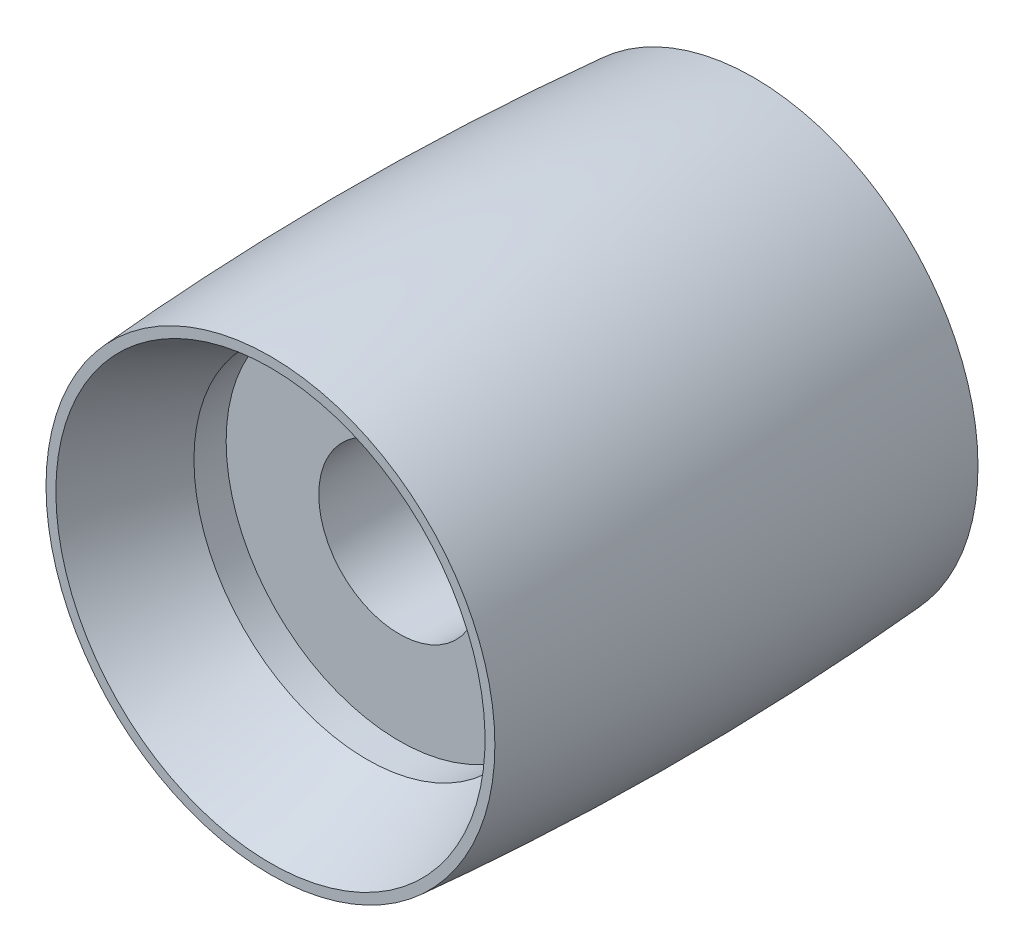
ISO-10303-21;
HEADER;
FILE_DESCRIPTION(('STEP AP214'),'2;1');
FILE_NAME('part.step','',(''),(''),'','','');
FILE_SCHEMA(('AUTOMOTIVE_DESIGN { 1 0 10303 214 1 1 1 1 }'));
ENDSEC;
DATA;
#1=APPLICATION_CONTEXT('core data for automotive mechanical design processes');
#2=APPLICATION_PROTOCOL_DEFINITION('international standard','automotive_design',2000,#1);
#3=PRODUCT_CONTEXT('',#1,'mechanical');
#4=PRODUCT('Part','Part','',(#3));
#5=PRODUCT_RELATED_PRODUCT_CATEGORY('part','',(#4));
#6=PRODUCT_DEFINITION_FORMATION('','',#4);
#7=PRODUCT_DEFINITION_CONTEXT('part definition',#1,'design');
#8=PRODUCT_DEFINITION('design','',#6,#7);
#9=PRODUCT_DEFINITION_SHAPE('','',#8);
#10=(LENGTH_UNIT() NAMED_UNIT(*) SI_UNIT(.MILLI.,.METRE.));
#11=(NAMED_UNIT(*) PLANE_ANGLE_UNIT() SI_UNIT($,.RADIAN.));
#12=(NAMED_UNIT(*) SI_UNIT($,.STERADIAN.) SOLID_ANGLE_UNIT());
#13=UNCERTAINTY_MEASURE_WITH_UNIT(LENGTH_MEASURE(1.E-05),#10,'distance_accuracy_value','');
#14=(GEOMETRIC_REPRESENTATION_CONTEXT(3) GLOBAL_UNCERTAINTY_ASSIGNED_CONTEXT((#13)) GLOBAL_UNIT_ASSIGNED_CONTEXT((#10,
#11,#12)) REPRESENTATION_CONTEXT('',''));
#15=CARTESIAN_POINT('',(0.,0.,0.));
#16=DIRECTION('',(0.,0.,1.));
#17=DIRECTION('',(1.,0.,0.));
#18=AXIS2_PLACEMENT_3D('',#15,#16,#17);
#19=CARTESIAN_POINT('',(0.,0.,30.));
#20=DIRECTION('',(0.,0.,1.));
#21=DIRECTION('',(-1.,0.,0.));
#22=AXIS2_PLACEMENT_3D('',#19,#20,#21);
#23=CONICAL_SURFACE('',#22,26.65,0.40539455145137);
#24=CARTESIAN_POINT('',(0.,0.,18.));
#25=DIRECTION('',(0.,0.,1.));
#26=DIRECTION('',(-1.,0.,0.));
#27=AXIS2_PLACEMENT_3D('',#24,#25,#26);
#28=CIRCLE('',#27,21.5);
#29=CARTESIAN_POINT('',(-21.5,0.,18.));
#30=VERTEX_POINT('',#29);
#31=EDGE_CURVE('E32',#30,#30,#28,.T.);
#32=ORIENTED_EDGE('',*,*,#31,.F.);
#33=EDGE_LOOP('',(#32));
#34=FACE_BOUND('',#33,.T.);
#35=CARTESIAN_POINT('',(0.,0.,30.));
#36=DIRECTION('',(0.,0.,-1.));
#37=DIRECTION('',(0.,1.,0.));
#38=AXIS2_PLACEMENT_3D('',#35,#36,#37);
#39=CIRCLE('',#38,26.65);
#40=CARTESIAN_POINT('',(0.,26.65,30.));
#41=VERTEX_POINT('',#40);
#42=EDGE_CURVE('E41',#41,#41,#39,.T.);
#43=ORIENTED_EDGE('',*,*,#42,.F.);
#44=EDGE_LOOP('',(#43));
#45=FACE_BOUND('',#44,.T.);
#46=ADVANCED_FACE('F12',(#34,#45),#23,.F.);
#47=CARTESIAN_POINT('',(0.,0.,-18.));
#48=DIRECTION('',(0.,0.,-1.));
#49=DIRECTION('',(1.,0.,0.));
#50=AXIS2_PLACEMENT_3D('',#47,#48,#49);
#51=CONICAL_SURFACE('',#50,21.5,0.40539455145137);
#52=CARTESIAN_POINT('',(0.,0.,-18.));
#53=DIRECTION('',(0.,0.,1.));
#54=DIRECTION('',(-1.,0.,0.));
#55=AXIS2_PLACEMENT_3D('',#52,#53,#54);
#56=CIRCLE('',#55,21.5);
#57=CARTESIAN_POINT('',(-21.5,0.,-18.));
#58=VERTEX_POINT('',#57);
#59=EDGE_CURVE('E27',#58,#58,#56,.T.);
#60=ORIENTED_EDGE('',*,*,#59,.T.);
#61=EDGE_LOOP('',(#60));
#62=FACE_BOUND('',#61,.T.);
#63=CARTESIAN_POINT('',(0.,0.,-30.));
#64=DIRECTION('',(0.,0.,-1.));
#65=DIRECTION('',(0.,1.,0.));
#66=AXIS2_PLACEMENT_3D('',#63,#64,#65);
#67=CIRCLE('',#66,26.65);
#68=CARTESIAN_POINT('',(0.,26.65,-30.));
#69=VERTEX_POINT('',#68);
#70=EDGE_CURVE('E44',#69,#69,#67,.T.);
#71=ORIENTED_EDGE('',*,*,#70,.T.);
#72=EDGE_LOOP('',(#71));
#73=FACE_BOUND('',#72,.T.);
#74=ADVANCED_FACE('F71',(#62,#73),#51,.F.);
#75=CARTESIAN_POINT('',(0.,-21.5,14.));
#76=DIRECTION('',(0.,0.,-1.));
#77=DIRECTION('',(1.,0.,0.));
#78=AXIS2_PLACEMENT_3D('',#75,#76,#77);
#79=PLANE('',#78);
#80=CARTESIAN_POINT('',(0.,0.,14.));
#81=DIRECTION('',(0.,0.,1.));
#82=DIRECTION('',(-1.,0.,0.));
#83=AXIS2_PLACEMENT_3D('',#80,#81,#82);
#84=CIRCLE('',#83,10.);
#85=CARTESIAN_POINT('',(-10.,0.,14.));
#86=VERTEX_POINT('',#85);
#87=EDGE_CURVE('E8',#86,#86,#84,.T.);
#88=ORIENTED_EDGE('',*,*,#87,.F.);
#89=EDGE_LOOP('',(#88));
#90=FACE_BOUND('',#89,.T.);
#91=CARTESIAN_POINT('',(0.,0.,14.));
#92=DIRECTION('',(0.,0.,1.));
#93=DIRECTION('',(-1.,0.,0.));
#94=AXIS2_PLACEMENT_3D('',#91,#92,#93);
#95=CIRCLE('',#94,21.5);
#96=CARTESIAN_POINT('',(-21.5,0.,14.));
#97=VERTEX_POINT('',#96);
#98=EDGE_CURVE('E35',#97,#97,#95,.T.);
#99=ORIENTED_EDGE('',*,*,#98,.T.);
#100=EDGE_LOOP('',(#99));
#101=FACE_BOUND('',#100,.T.);
#102=ADVANCED_FACE('F14',(#90,#101),#79,.F.);
#103=CARTESIAN_POINT('',(0.,0.,35.6771191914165));
#104=DIRECTION('',(0.,0.,1.));
#105=DIRECTION('',(-1.,0.,0.));
#106=AXIS2_PLACEMENT_3D('',#103,#104,#105);
#107=CYLINDRICAL_SURFACE('',#106,10.);
#108=CARTESIAN_POINT('',(0.,0.,-14.));
#109=DIRECTION('',(0.,0.,1.));
#110=DIRECTION('',(-1.,0.,0.));
#111=AXIS2_PLACEMENT_3D('',#108,#109,#110);
#112=CIRCLE('',#111,10.);
#113=CARTESIAN_POINT('',(-10.,0.,-14.));
#114=VERTEX_POINT('',#113);
#115=EDGE_CURVE('E19',#114,#114,#112,.T.);
#116=ORIENTED_EDGE('',*,*,#115,.F.);
#117=EDGE_LOOP('',(#116));
#118=FACE_BOUND('',#117,.T.);
#119=ORIENTED_EDGE('',*,*,#87,.T.);
#120=EDGE_LOOP('',(#119));
#121=FACE_BOUND('',#120,.T.);
#122=ADVANCED_FACE('F89',(#118,#121),#107,.F.);
#123=CARTESIAN_POINT('',(0.,-10.,-14.));
#124=DIRECTION('',(0.,0.,1.));
#125=DIRECTION('',(-1.,0.,0.));
#126=AXIS2_PLACEMENT_3D('',#123,#124,#125);
#127=PLANE('',#126);
#128=CARTESIAN_POINT('',(0.,0.,-14.));
#129=DIRECTION('',(0.,0.,1.));
#130=DIRECTION('',(-1.,0.,0.));
#131=AXIS2_PLACEMENT_3D('',#128,#129,#130);
#132=CIRCLE('',#131,21.5);
#133=CARTESIAN_POINT('',(-21.5,0.,-14.));
#134=VERTEX_POINT('',#133);
#135=EDGE_CURVE('E23',#134,#134,#132,.T.);
#136=ORIENTED_EDGE('',*,*,#135,.F.);
#137=EDGE_LOOP('',(#136));
#138=FACE_BOUND('',#137,.T.);
#139=ORIENTED_EDGE('',*,*,#115,.T.);
#140=EDGE_LOOP('',(#139));
#141=FACE_BOUND('',#140,.T.);
#142=ADVANCED_FACE('F86',(#138,#141),#127,.F.);
#143=CARTESIAN_POINT('',(0.,0.,35.6771191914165));
#144=DIRECTION('',(0.,0.,1.));
#145=DIRECTION('',(-1.,0.,0.));
#146=AXIS2_PLACEMENT_3D('',#143,#144,#145);
#147=CYLINDRICAL_SURFACE('',#146,21.5);
#148=ORIENTED_EDGE('',*,*,#59,.F.);
#149=EDGE_LOOP('',(#148));
#150=FACE_BOUND('',#149,.T.);
#151=ORIENTED_EDGE('',*,*,#135,.T.);
#152=EDGE_LOOP('',(#151));
#153=FACE_BOUND('',#152,.T.);
#154=ADVANCED_FACE('F83',(#150,#153),#147,.F.);
#155=CARTESIAN_POINT('',(0.,0.,35.6771191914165));
#156=DIRECTION('',(0.,0.,1.));
#157=DIRECTION('',(-1.,0.,0.));
#158=AXIS2_PLACEMENT_3D('',#155,#156,#157);
#159=CYLINDRICAL_SURFACE('',#158,21.5);
#160=ORIENTED_EDGE('',*,*,#98,.F.);
#161=EDGE_LOOP('',(#160));
#162=FACE_BOUND('',#161,.T.);
#163=ORIENTED_EDGE('',*,*,#31,.T.);
#164=EDGE_LOOP('',(#163));
#165=FACE_BOUND('',#164,.T.);
#166=ADVANCED_FACE('F66',(#162,#165),#159,.F.);
#167=CARTESIAN_POINT('',(0.,27.8734135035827,30.));
#168=DIRECTION('',(0.,0.,1.));
#169=DIRECTION('',(0.,-1.,0.));
#170=AXIS2_PLACEMENT_3D('',#167,#168,#169);
#171=PLANE('',#170);
#172=ORIENTED_EDGE('',*,*,#42,.T.);
#173=EDGE_LOOP('',(#172));
#174=FACE_BOUND('',#173,.T.);
#175=CARTESIAN_POINT('',(0.,0.,30.));
#176=DIRECTION('',(0.,0.,-1.));
#177=DIRECTION('',(0.,1.,0.));
#178=AXIS2_PLACEMENT_3D('',#175,#176,#177);
#179=CIRCLE('',#178,27.8734135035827);
#180=CARTESIAN_POINT('',(0.,27.8734135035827,30.));
#181=VERTEX_POINT('',#180);
#182=EDGE_CURVE('E38',#181,#181,#179,.T.);
#183=ORIENTED_EDGE('',*,*,#182,.F.);
#184=EDGE_LOOP('',(#183));
#185=FACE_BOUND('',#184,.T.);
#186=ADVANCED_FACE('F56',(#174,#185),#171,.T.);
#187=CARTESIAN_POINT('',(0.,0.,0.));
#188=DIRECTION('',(0.,0.,-1.));
#189=DIRECTION('',(1.,0.,0.));
#190=AXIS2_PLACEMENT_3D('',#187,#188,#189);
#191=DEGENERATE_TOROIDAL_SURFACE('',#190,371.,400.,.F.);
#192=ORIENTED_EDGE('',*,*,#182,.T.);
#193=EDGE_LOOP('',(#192));
#194=FACE_BOUND('',#193,.T.);
#195=CARTESIAN_POINT('',(0.,0.,-30.));
#196=DIRECTION('',(0.,0.,-1.));
#197=DIRECTION('',(0.,1.,0.));
#198=AXIS2_PLACEMENT_3D('',#195,#196,#197);
#199=CIRCLE('',#198,27.8734135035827);
#200=CARTESIAN_POINT('',(0.,27.8734135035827,-30.));
#201=VERTEX_POINT('',#200);
#202=EDGE_CURVE('E47',#201,#201,#199,.T.);
#203=ORIENTED_EDGE('',*,*,#202,.F.);
#204=EDGE_LOOP('',(#203));
#205=FACE_BOUND('',#204,.T.);
#206=ADVANCED_FACE('F54',(#194,#205),#191,.F.);
#207=CARTESIAN_POINT('',(0.,27.8734135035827,-30.));
#208=DIRECTION('',(0.,0.,-1.));
#209=DIRECTION('',(0.,1.,0.));
#210=AXIS2_PLACEMENT_3D('',#207,#208,#209);
#211=PLANE('',#210);
#212=ORIENTED_EDGE('',*,*,#202,.T.);
#213=EDGE_LOOP('',(#212));
#214=FACE_BOUND('',#213,.T.);
#215=ORIENTED_EDGE('',*,*,#70,.F.);
#216=EDGE_LOOP('',(#215));
#217=FACE_BOUND('',#216,.T.);
#218=ADVANCED_FACE('F51',(#214,#217),#211,.T.);
#219=CLOSED_SHELL('',(#46,#74,#102,#122,#142,#154,#166,#186,#206,#218));
#220=MANIFOLD_SOLID_BREP('B1',#219);
#221=ADVANCED_BREP_SHAPE_REPRESENTATION('',(#18,#220),#14);
#222=SHAPE_DEFINITION_REPRESENTATION(#9,#221);
ENDSEC;
END-ISO-10303-21;
